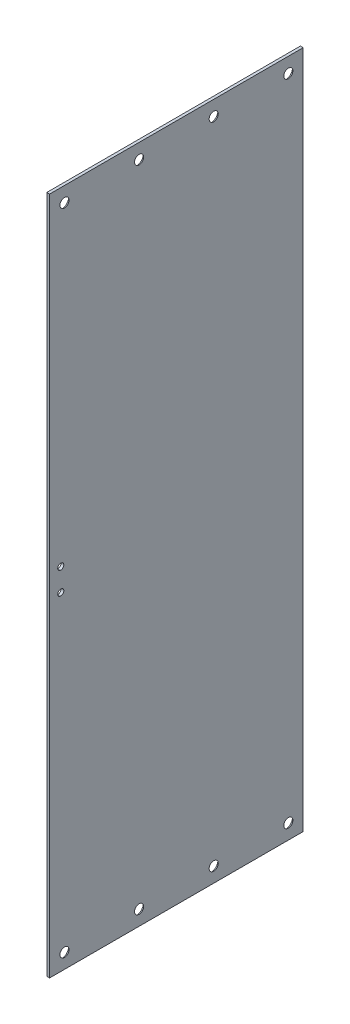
ISO-10303-21;
HEADER;
FILE_DESCRIPTION(('STEP AP214'),'2;1');
FILE_NAME('part.step','',(''),(''),'','','');
FILE_SCHEMA(('AUTOMOTIVE_DESIGN { 1 0 10303 214 1 1 1 1 }'));
ENDSEC;
DATA;
#1=APPLICATION_CONTEXT('core data for automotive mechanical design processes');
#2=APPLICATION_PROTOCOL_DEFINITION('international standard','automotive_design',2000,#1);
#3=PRODUCT_CONTEXT('',#1,'mechanical');
#4=PRODUCT('Part','Part','',(#3));
#5=PRODUCT_RELATED_PRODUCT_CATEGORY('part','',(#4));
#6=PRODUCT_DEFINITION_FORMATION('','',#4);
#7=PRODUCT_DEFINITION_CONTEXT('part definition',#1,'design');
#8=PRODUCT_DEFINITION('design','',#6,#7);
#9=PRODUCT_DEFINITION_SHAPE('','',#8);
#10=(LENGTH_UNIT() NAMED_UNIT(*) SI_UNIT(.MILLI.,.METRE.));
#11=(NAMED_UNIT(*) PLANE_ANGLE_UNIT() SI_UNIT($,.RADIAN.));
#12=(NAMED_UNIT(*) SI_UNIT($,.STERADIAN.) SOLID_ANGLE_UNIT());
#13=UNCERTAINTY_MEASURE_WITH_UNIT(LENGTH_MEASURE(1.E-05),#10,'distance_accuracy_value','');
#14=(GEOMETRIC_REPRESENTATION_CONTEXT(3) GLOBAL_UNCERTAINTY_ASSIGNED_CONTEXT((#13)) GLOBAL_UNIT_ASSIGNED_CONTEXT((#10,
#11,#12)) REPRESENTATION_CONTEXT('',''));
#15=CARTESIAN_POINT('',(0.,0.,0.));
#16=DIRECTION('',(0.,0.,1.));
#17=DIRECTION('',(1.,0.,0.));
#18=AXIS2_PLACEMENT_3D('',#15,#16,#17);
#19=CARTESIAN_POINT('',(-2.3812499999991,-577.85,215.9));
#20=DIRECTION('',(-1.,0.,0.));
#21=DIRECTION('',(0.,0.,1.));
#22=AXIS2_PLACEMENT_3D('',#19,#20,#21);
#23=PLANE('',#22);
#24=DIRECTION('',(0.,0.,1.));
#25=VECTOR('',#24,1.);
#26=CARTESIAN_POINT('',(-2.3812499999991,577.85,-215.9));
#27=LINE('',#26,#25);
#28=CARTESIAN_POINT('',(-2.3812499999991,577.85,-215.9));
#29=VERTEX_POINT('',#28);
#30=CARTESIAN_POINT('',(-2.3812499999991,577.85,215.9));
#31=VERTEX_POINT('',#30);
#32=EDGE_CURVE('E358',#29,#31,#27,.T.);
#33=ORIENTED_EDGE('',*,*,#32,.F.);
#34=DIRECTION('',(0.,1.,0.));
#35=VECTOR('',#34,1.);
#36=CARTESIAN_POINT('',(-2.3812499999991,-577.85,-215.9));
#37=LINE('',#36,#35);
#38=CARTESIAN_POINT('',(-2.3812499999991,-577.85,-215.9));
#39=VERTEX_POINT('',#38);
#40=EDGE_CURVE('E362',#39,#29,#37,.T.);
#41=ORIENTED_EDGE('',*,*,#40,.F.);
#42=DIRECTION('',(0.,0.,-1.));
#43=VECTOR('',#42,1.);
#44=CARTESIAN_POINT('',(-2.3812499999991,-577.85,215.9));
#45=LINE('',#44,#43);
#46=CARTESIAN_POINT('',(-2.3812499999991,-577.85,215.9));
#47=VERTEX_POINT('',#46);
#48=EDGE_CURVE('E366',#47,#39,#45,.T.);
#49=ORIENTED_EDGE('',*,*,#48,.F.);
#50=DIRECTION('',(0.,1.,0.));
#51=VECTOR('',#50,1.);
#52=CARTESIAN_POINT('',(-2.3812499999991,577.85,215.9));
#53=LINE('',#52,#51);
#54=EDGE_CURVE('E373',#31,#47,#53,.F.);
#55=ORIENTED_EDGE('',*,*,#54,.F.);
#56=EDGE_LOOP('',(#33,#41,#49,#55));
#57=FACE_BOUND('',#56,.T.);
#58=CARTESIAN_POINT('',(-2.3812499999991,19.0500000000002,196.85));
#59=DIRECTION('',(-1.,0.,0.));
#60=DIRECTION('',(0.,0.,1.));
#61=AXIS2_PLACEMENT_3D('',#58,#59,#60);
#62=CIRCLE('',#61,5.16001);
#63=CARTESIAN_POINT('',(-2.3812499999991,24.2100100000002,196.85));
#64=VERTEX_POINT('',#63);
#65=CARTESIAN_POINT('',(-2.3812499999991,13.8899900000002,196.85));
#66=VERTEX_POINT('',#65);
#67=EDGE_CURVE('E258',#64,#66,#62,.F.);
#68=ORIENTED_EDGE('',*,*,#67,.T.);
#69=CARTESIAN_POINT('',(-2.3812499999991,19.0500000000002,196.85));
#70=DIRECTION('',(-1.,0.,0.));
#71=DIRECTION('',(0.,0.,1.));
#72=AXIS2_PLACEMENT_3D('',#69,#70,#71);
#73=CIRCLE('',#72,5.16001);
#74=EDGE_CURVE('E254',#66,#64,#73,.F.);
#75=ORIENTED_EDGE('',*,*,#74,.T.);
#76=EDGE_LOOP('',(#68,#75));
#77=FACE_BOUND('',#76,.T.);
#78=CARTESIAN_POINT('',(-2.3812499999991,-19.0499999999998,196.85));
#79=DIRECTION('',(-1.,0.,0.));
#80=DIRECTION('',(0.,0.,1.));
#81=AXIS2_PLACEMENT_3D('',#78,#79,#80);
#82=CIRCLE('',#81,5.16001);
#83=CARTESIAN_POINT('',(-2.3812499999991,-13.8899899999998,196.85));
#84=VERTEX_POINT('',#83);
#85=CARTESIAN_POINT('',(-2.3812499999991,-24.2100099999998,196.85));
#86=VERTEX_POINT('',#85);
#87=EDGE_CURVE('E266',#84,#86,#82,.F.);
#88=ORIENTED_EDGE('',*,*,#87,.T.);
#89=CARTESIAN_POINT('',(-2.3812499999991,-19.0499999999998,196.85));
#90=DIRECTION('',(-1.,0.,0.));
#91=DIRECTION('',(0.,0.,1.));
#92=AXIS2_PLACEMENT_3D('',#89,#90,#91);
#93=CIRCLE('',#92,5.16001);
#94=EDGE_CURVE('E262',#86,#84,#93,.F.);
#95=ORIENTED_EDGE('',*,*,#94,.T.);
#96=EDGE_LOOP('',(#88,#95));
#97=FACE_BOUND('',#96,.T.);
#98=CARTESIAN_POINT('',(-2.3812500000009,552.45,190.5));
#99=DIRECTION('',(-1.,0.,0.));
#100=DIRECTION('',(0.,0.,1.));
#101=AXIS2_PLACEMENT_3D('',#98,#99,#100);
#102=CIRCLE('',#101,11.9062500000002);
#103=CARTESIAN_POINT('',(-2.38124999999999,552.45,202.406249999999));
#104=VERTEX_POINT('',#103);
#105=CARTESIAN_POINT('',(-2.38124999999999,552.45,178.59375));
#106=VERTEX_POINT('',#105);
#107=EDGE_CURVE('E270',#104,#106,#102,.F.);
#108=ORIENTED_EDGE('',*,*,#107,.T.);
#109=CARTESIAN_POINT('',(-2.38124999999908,552.45,190.5));
#110=DIRECTION('',(-1.,0.,0.));
#111=DIRECTION('',(0.,0.,1.));
#112=AXIS2_PLACEMENT_3D('',#109,#110,#111);
#113=CIRCLE('',#112,11.9062499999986);
#114=EDGE_CURVE('E274',#106,#104,#113,.F.);
#115=ORIENTED_EDGE('',*,*,#114,.T.);
#116=EDGE_LOOP('',(#108,#115));
#117=FACE_BOUND('',#116,.T.);
#118=CARTESIAN_POINT('',(-2.3812500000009,552.45,-63.5000000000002));
#119=DIRECTION('',(-1.,0.,0.));
#120=DIRECTION('',(0.,0.,1.));
#121=AXIS2_PLACEMENT_3D('',#118,#119,#120);
#122=CIRCLE('',#121,11.9062500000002);
#123=CARTESIAN_POINT('',(-2.38125,552.45,-51.5937500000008));
#124=VERTEX_POINT('',#123);
#125=CARTESIAN_POINT('',(-2.38125,552.45,-75.4062499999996));
#126=VERTEX_POINT('',#125);
#127=EDGE_CURVE('E278',#124,#126,#122,.F.);
#128=ORIENTED_EDGE('',*,*,#127,.T.);
#129=CARTESIAN_POINT('',(-2.3812499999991,552.45,-63.5000000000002));
#130=DIRECTION('',(-1.,0.,0.));
#131=DIRECTION('',(0.,0.,1.));
#132=AXIS2_PLACEMENT_3D('',#129,#130,#131);
#133=CIRCLE('',#132,11.9062499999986);
#134=EDGE_CURVE('E282',#126,#124,#133,.F.);
#135=ORIENTED_EDGE('',*,*,#134,.T.);
#136=EDGE_LOOP('',(#128,#135));
#137=FACE_BOUND('',#136,.T.);
#138=CARTESIAN_POINT('',(-2.3812500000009,-552.45,190.5));
#139=DIRECTION('',(-1.,0.,0.));
#140=DIRECTION('',(0.,0.,1.));
#141=AXIS2_PLACEMENT_3D('',#138,#139,#140);
#142=CIRCLE('',#141,11.9062500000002);
#143=CARTESIAN_POINT('',(-2.38124999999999,-552.45,202.406249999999));
#144=VERTEX_POINT('',#143);
#145=CARTESIAN_POINT('',(-2.38124999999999,-552.45,178.59375));
#146=VERTEX_POINT('',#145);
#147=EDGE_CURVE('E286',#144,#146,#142,.F.);
#148=ORIENTED_EDGE('',*,*,#147,.T.);
#149=CARTESIAN_POINT('',(-2.38124999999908,-552.45,190.5));
#150=DIRECTION('',(-1.,0.,0.));
#151=DIRECTION('',(0.,0.,1.));
#152=AXIS2_PLACEMENT_3D('',#149,#150,#151);
#153=CIRCLE('',#152,11.9062499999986);
#154=EDGE_CURVE('E290',#146,#144,#153,.F.);
#155=ORIENTED_EDGE('',*,*,#154,.T.);
#156=EDGE_LOOP('',(#148,#155));
#157=FACE_BOUND('',#156,.T.);
#158=CARTESIAN_POINT('',(-2.3812500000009,-552.45,-63.5000000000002));
#159=DIRECTION('',(-1.,0.,0.));
#160=DIRECTION('',(0.,0.,1.));
#161=AXIS2_PLACEMENT_3D('',#158,#159,#160);
#162=CIRCLE('',#161,11.9062500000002);
#163=CARTESIAN_POINT('',(-2.38125,-552.45,-51.5937500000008));
#164=VERTEX_POINT('',#163);
#165=CARTESIAN_POINT('',(-2.38125,-552.45,-75.4062499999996));
#166=VERTEX_POINT('',#165);
#167=EDGE_CURVE('E294',#164,#166,#162,.F.);
#168=ORIENTED_EDGE('',*,*,#167,.T.);
#169=CARTESIAN_POINT('',(-2.3812499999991,-552.45,-63.5000000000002));
#170=DIRECTION('',(-1.,0.,0.));
#171=DIRECTION('',(0.,0.,1.));
#172=AXIS2_PLACEMENT_3D('',#169,#170,#171);
#173=CIRCLE('',#172,11.9062499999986);
#174=EDGE_CURVE('E298',#166,#164,#173,.F.);
#175=ORIENTED_EDGE('',*,*,#174,.T.);
#176=EDGE_LOOP('',(#168,#175));
#177=FACE_BOUND('',#176,.T.);
#178=CARTESIAN_POINT('',(-2.3812500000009,-552.45,-190.5));
#179=DIRECTION('',(-1.,0.,0.));
#180=DIRECTION('',(0.,0.,1.));
#181=AXIS2_PLACEMENT_3D('',#178,#179,#180);
#182=CIRCLE('',#181,11.9062500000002);
#183=CARTESIAN_POINT('',(-2.38124999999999,-552.45,-178.593750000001));
#184=VERTEX_POINT('',#183);
#185=CARTESIAN_POINT('',(-2.38124999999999,-552.45,-202.40625));
#186=VERTEX_POINT('',#185);
#187=EDGE_CURVE('E302',#184,#186,#182,.F.);
#188=ORIENTED_EDGE('',*,*,#187,.T.);
#189=CARTESIAN_POINT('',(-2.38124999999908,-552.45,-190.5));
#190=DIRECTION('',(-1.,0.,0.));
#191=DIRECTION('',(0.,0.,1.));
#192=AXIS2_PLACEMENT_3D('',#189,#190,#191);
#193=CIRCLE('',#192,11.9062499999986);
#194=EDGE_CURVE('E306',#186,#184,#193,.F.);
#195=ORIENTED_EDGE('',*,*,#194,.T.);
#196=EDGE_LOOP('',(#188,#195));
#197=FACE_BOUND('',#196,.T.);
#198=CARTESIAN_POINT('',(-2.3812500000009,-552.45,63.4999999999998));
#199=DIRECTION('',(-1.,0.,0.));
#200=DIRECTION('',(0.,0.,1.));
#201=AXIS2_PLACEMENT_3D('',#198,#199,#200);
#202=CIRCLE('',#201,11.9062500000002);
#203=CARTESIAN_POINT('',(-2.38125,-552.45,75.4062499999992));
#204=VERTEX_POINT('',#203);
#205=CARTESIAN_POINT('',(-2.38125,-552.45,51.5937500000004));
#206=VERTEX_POINT('',#205);
#207=EDGE_CURVE('E310',#204,#206,#202,.F.);
#208=ORIENTED_EDGE('',*,*,#207,.T.);
#209=CARTESIAN_POINT('',(-2.3812499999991,-552.45,63.4999999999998));
#210=DIRECTION('',(-1.,0.,0.));
#211=DIRECTION('',(0.,0.,1.));
#212=AXIS2_PLACEMENT_3D('',#209,#210,#211);
#213=CIRCLE('',#212,11.9062499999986);
#214=EDGE_CURVE('E314',#206,#204,#213,.F.);
#215=ORIENTED_EDGE('',*,*,#214,.T.);
#216=EDGE_LOOP('',(#208,#215));
#217=FACE_BOUND('',#216,.T.);
#218=CARTESIAN_POINT('',(-2.3812500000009,552.45,-190.5));
#219=DIRECTION('',(-1.,0.,0.));
#220=DIRECTION('',(0.,0.,1.));
#221=AXIS2_PLACEMENT_3D('',#218,#219,#220);
#222=CIRCLE('',#221,11.9062500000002);
#223=CARTESIAN_POINT('',(-2.38124999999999,552.45,-178.593750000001));
#224=VERTEX_POINT('',#223);
#225=CARTESIAN_POINT('',(-2.38124999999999,552.45,-202.40625));
#226=VERTEX_POINT('',#225);
#227=EDGE_CURVE('E191',#224,#226,#222,.F.);
#228=ORIENTED_EDGE('',*,*,#227,.T.);
#229=CARTESIAN_POINT('',(-2.38124999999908,552.45,-190.5));
#230=DIRECTION('',(-1.,0.,0.));
#231=DIRECTION('',(0.,0.,1.));
#232=AXIS2_PLACEMENT_3D('',#229,#230,#231);
#233=CIRCLE('',#232,11.9062499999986);
#234=EDGE_CURVE('E188',#226,#224,#233,.F.);
#235=ORIENTED_EDGE('',*,*,#234,.T.);
#236=EDGE_LOOP('',(#228,#235));
#237=FACE_BOUND('',#236,.T.);
#238=CARTESIAN_POINT('',(-2.3812500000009,552.45,63.4999999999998));
#239=DIRECTION('',(-1.,0.,0.));
#240=DIRECTION('',(0.,0.,1.));
#241=AXIS2_PLACEMENT_3D('',#238,#239,#240);
#242=CIRCLE('',#241,11.9062500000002);
#243=CARTESIAN_POINT('',(-2.38125,552.45,75.4062499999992));
#244=VERTEX_POINT('',#243);
#245=CARTESIAN_POINT('',(-2.38125,552.45,51.5937500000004));
#246=VERTEX_POINT('',#245);
#247=EDGE_CURVE('E178',#244,#246,#242,.F.);
#248=ORIENTED_EDGE('',*,*,#247,.T.);
#249=CARTESIAN_POINT('',(-2.3812499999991,552.45,63.4999999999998));
#250=DIRECTION('',(-1.,0.,0.));
#251=DIRECTION('',(0.,0.,1.));
#252=AXIS2_PLACEMENT_3D('',#249,#250,#251);
#253=CIRCLE('',#252,11.9062499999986);
#254=EDGE_CURVE('E19',#246,#244,#253,.F.);
#255=ORIENTED_EDGE('',*,*,#254,.T.);
#256=EDGE_LOOP('',(#248,#255));
#257=FACE_BOUND('',#256,.T.);
#258=ADVANCED_FACE('F16',(#57,#77,#97,#117,#137,#157,#177,#197,#217,#237,#257),#23,.T.);
#259=CARTESIAN_POINT('',(-2.3812499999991,552.45,63.4999999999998));
#260=DIRECTION('',(-1.,0.,0.));
#261=DIRECTION('',(0.,0.,1.));
#262=AXIS2_PLACEMENT_3D('',#259,#260,#261);
#263=CONICAL_SURFACE('',#262,11.9062499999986,0.715584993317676);
#264=ORIENTED_EDGE('',*,*,#254,.F.);
#265=DIRECTION('',(0.754709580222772,0.,0.656059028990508));
#266=VECTOR('',#265,1.);
#267=CARTESIAN_POINT('',(0.806449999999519,552.45,54.3647753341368));
#268=LINE('',#267,#266);
#269=CARTESIAN_POINT('',(2.3812500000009,552.45,55.733728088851));
#270=VERTEX_POINT('',#269);
#271=EDGE_CURVE('E183',#246,#270,#268,.T.);
#272=ORIENTED_EDGE('',*,*,#271,.T.);
#273=CARTESIAN_POINT('',(2.3812500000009,552.45,63.4999999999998));
#274=DIRECTION('',(-1.,0.,0.));
#275=DIRECTION('',(0.,0.,1.));
#276=AXIS2_PLACEMENT_3D('',#273,#274,#275);
#277=CIRCLE('',#276,7.76627191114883);
#278=CARTESIAN_POINT('',(2.3812500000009,552.45,71.2662719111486));
#279=VERTEX_POINT('',#278);
#280=EDGE_CURVE('E187',#270,#279,#277,.F.);
#281=ORIENTED_EDGE('',*,*,#280,.T.);
#282=DIRECTION('',(0.754709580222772,0.,-0.656059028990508));
#283=VECTOR('',#282,1.);
#284=CARTESIAN_POINT('',(0.806449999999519,552.45,72.6352246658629));
#285=LINE('',#284,#283);
#286=EDGE_CURVE('E181',#279,#244,#285,.F.);
#287=ORIENTED_EDGE('',*,*,#286,.T.);
#288=EDGE_LOOP('',(#264,#272,#281,#287));
#289=FACE_BOUND('',#288,.T.);
#290=ADVANCED_FACE('F186',(#289),#263,.F.);
#291=CARTESIAN_POINT('',(-2.38125000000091,552.45,63.4999999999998));
#292=DIRECTION('',(-1.,0.,0.));
#293=DIRECTION('',(0.,0.,1.));
#294=AXIS2_PLACEMENT_3D('',#291,#292,#293);
#295=CONICAL_SURFACE('',#294,11.9062500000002,0.715584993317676);
#296=CARTESIAN_POINT('',(2.3812500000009,552.45,63.4999999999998));
#297=DIRECTION('',(-1.,0.,0.));
#298=DIRECTION('',(0.,0.,1.));
#299=AXIS2_PLACEMENT_3D('',#296,#297,#298);
#300=CIRCLE('',#299,7.76627191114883);
#301=EDGE_CURVE('E251',#279,#270,#300,.F.);
#302=ORIENTED_EDGE('',*,*,#301,.T.);
#303=ORIENTED_EDGE('',*,*,#271,.F.);
#304=ORIENTED_EDGE('',*,*,#247,.F.);
#305=ORIENTED_EDGE('',*,*,#286,.F.);
#306=EDGE_LOOP('',(#302,#303,#304,#305));
#307=FACE_BOUND('',#306,.T.);
#308=ADVANCED_FACE('F180',(#307),#295,.F.);
#309=CARTESIAN_POINT('',(-2.38124999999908,552.45,-190.5));
#310=DIRECTION('',(-1.,0.,0.));
#311=DIRECTION('',(0.,0.,1.));
#312=AXIS2_PLACEMENT_3D('',#309,#310,#311);
#313=CONICAL_SURFACE('',#312,11.9062499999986,0.715584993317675);
#314=ORIENTED_EDGE('',*,*,#234,.F.);
#315=DIRECTION('',(0.754709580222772,0.,0.656059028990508));
#316=VECTOR('',#315,1.);
#317=CARTESIAN_POINT('',(0.806449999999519,552.45,-199.635224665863));
#318=LINE('',#317,#316);
#319=CARTESIAN_POINT('',(2.3812500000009,552.45,-198.266271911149));
#320=VERTEX_POINT('',#319);
#321=EDGE_CURVE('E319',#226,#320,#318,.T.);
#322=ORIENTED_EDGE('',*,*,#321,.T.);
#323=CARTESIAN_POINT('',(2.38125000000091,552.45,-190.5));
#324=DIRECTION('',(-1.,0.,0.));
#325=DIRECTION('',(0.,0.,1.));
#326=AXIS2_PLACEMENT_3D('',#323,#324,#325);
#327=CIRCLE('',#326,7.76627191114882);
#328=CARTESIAN_POINT('',(2.3812500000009,552.45,-182.733728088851));
#329=VERTEX_POINT('',#328);
#330=EDGE_CURVE('E248',#320,#329,#327,.F.);
#331=ORIENTED_EDGE('',*,*,#330,.T.);
#332=DIRECTION('',(0.754709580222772,0.,-0.656059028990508));
#333=VECTOR('',#332,1.);
#334=CARTESIAN_POINT('',(0.806449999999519,552.45,-181.364775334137));
#335=LINE('',#334,#333);
#336=EDGE_CURVE('E317',#329,#224,#335,.F.);
#337=ORIENTED_EDGE('',*,*,#336,.T.);
#338=EDGE_LOOP('',(#314,#322,#331,#337));
#339=FACE_BOUND('',#338,.T.);
#340=ADVANCED_FACE('F482',(#339),#313,.F.);
#341=CARTESIAN_POINT('',(-2.3812500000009,552.45,-190.5));
#342=DIRECTION('',(-1.,0.,0.));
#343=DIRECTION('',(0.,0.,1.));
#344=AXIS2_PLACEMENT_3D('',#341,#342,#343);
#345=CONICAL_SURFACE('',#344,11.9062500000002,0.715584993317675);
#346=CARTESIAN_POINT('',(2.3812500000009,552.45,-190.5));
#347=DIRECTION('',(-1.,0.,0.));
#348=DIRECTION('',(0.,0.,1.));
#349=AXIS2_PLACEMENT_3D('',#346,#347,#348);
#350=CIRCLE('',#349,7.76627191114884);
#351=EDGE_CURVE('E245',#329,#320,#350,.F.);
#352=ORIENTED_EDGE('',*,*,#351,.T.);
#353=ORIENTED_EDGE('',*,*,#321,.F.);
#354=ORIENTED_EDGE('',*,*,#227,.F.);
#355=ORIENTED_EDGE('',*,*,#336,.F.);
#356=EDGE_LOOP('',(#352,#353,#354,#355));
#357=FACE_BOUND('',#356,.T.);
#358=ADVANCED_FACE('F478',(#357),#345,.F.);
#359=CARTESIAN_POINT('',(-2.3812499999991,-552.45,63.4999999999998));
#360=DIRECTION('',(-1.,0.,0.));
#361=DIRECTION('',(0.,0.,1.));
#362=AXIS2_PLACEMENT_3D('',#359,#360,#361);
#363=CONICAL_SURFACE('',#362,11.9062499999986,0.715584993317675);
#364=ORIENTED_EDGE('',*,*,#214,.F.);
#365=DIRECTION('',(0.754709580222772,0.,0.656059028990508));
#366=VECTOR('',#365,1.);
#367=CARTESIAN_POINT('',(0.806449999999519,-552.45,54.3647753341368));
#368=LINE('',#367,#366);
#369=CARTESIAN_POINT('',(2.3812500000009,-552.45,55.733728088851));
#370=VERTEX_POINT('',#369);
#371=EDGE_CURVE('E313',#206,#370,#368,.T.);
#372=ORIENTED_EDGE('',*,*,#371,.T.);
#373=CARTESIAN_POINT('',(2.3812500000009,-552.45,63.4999999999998));
#374=DIRECTION('',(-1.,0.,0.));
#375=DIRECTION('',(0.,0.,1.));
#376=AXIS2_PLACEMENT_3D('',#373,#374,#375);
#377=CIRCLE('',#376,7.76627191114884);
#378=CARTESIAN_POINT('',(2.3812500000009,-552.45,71.2662719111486));
#379=VERTEX_POINT('',#378);
#380=EDGE_CURVE('E242',#370,#379,#377,.F.);
#381=ORIENTED_EDGE('',*,*,#380,.T.);
#382=DIRECTION('',(0.754709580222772,0.,-0.656059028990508));
#383=VECTOR('',#382,1.);
#384=CARTESIAN_POINT('',(0.806449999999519,-552.45,72.6352246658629));
#385=LINE('',#384,#383);
#386=EDGE_CURVE('E309',#379,#204,#385,.F.);
#387=ORIENTED_EDGE('',*,*,#386,.T.);
#388=EDGE_LOOP('',(#364,#372,#381,#387));
#389=FACE_BOUND('',#388,.T.);
#390=ADVANCED_FACE('F474',(#389),#363,.F.);
#391=CARTESIAN_POINT('',(-2.38125000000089,-552.45,63.4999999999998));
#392=DIRECTION('',(-1.,0.,0.));
#393=DIRECTION('',(0.,0.,1.));
#394=AXIS2_PLACEMENT_3D('',#391,#392,#393);
#395=CONICAL_SURFACE('',#394,11.9062500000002,0.715584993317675);
#396=CARTESIAN_POINT('',(2.3812500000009,-552.45,63.4999999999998));
#397=DIRECTION('',(-1.,0.,0.));
#398=DIRECTION('',(0.,0.,1.));
#399=AXIS2_PLACEMENT_3D('',#396,#397,#398);
#400=CIRCLE('',#399,7.76627191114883);
#401=EDGE_CURVE('E239',#379,#370,#400,.F.);
#402=ORIENTED_EDGE('',*,*,#401,.T.);
#403=ORIENTED_EDGE('',*,*,#371,.F.);
#404=ORIENTED_EDGE('',*,*,#207,.F.);
#405=ORIENTED_EDGE('',*,*,#386,.F.);
#406=EDGE_LOOP('',(#402,#403,#404,#405));
#407=FACE_BOUND('',#406,.T.);
#408=ADVANCED_FACE('F470',(#407),#395,.F.);
#409=CARTESIAN_POINT('',(-2.38124999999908,-552.45,-190.5));
#410=DIRECTION('',(-1.,0.,0.));
#411=DIRECTION('',(0.,0.,1.));
#412=AXIS2_PLACEMENT_3D('',#409,#410,#411);
#413=CONICAL_SURFACE('',#412,11.9062499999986,0.715584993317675);
#414=ORIENTED_EDGE('',*,*,#194,.F.);
#415=DIRECTION('',(0.754709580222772,0.,0.656059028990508));
#416=VECTOR('',#415,1.);
#417=CARTESIAN_POINT('',(0.806449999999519,-552.45,-199.635224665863));
#418=LINE('',#417,#416);
#419=CARTESIAN_POINT('',(2.3812500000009,-552.45,-198.266271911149));
#420=VERTEX_POINT('',#419);
#421=EDGE_CURVE('E305',#186,#420,#418,.T.);
#422=ORIENTED_EDGE('',*,*,#421,.T.);
#423=CARTESIAN_POINT('',(2.38125000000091,-552.45,-190.5));
#424=DIRECTION('',(-1.,0.,0.));
#425=DIRECTION('',(0.,0.,1.));
#426=AXIS2_PLACEMENT_3D('',#423,#424,#425);
#427=CIRCLE('',#426,7.76627191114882);
#428=CARTESIAN_POINT('',(2.3812500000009,-552.45,-182.733728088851));
#429=VERTEX_POINT('',#428);
#430=EDGE_CURVE('E236',#420,#429,#427,.F.);
#431=ORIENTED_EDGE('',*,*,#430,.T.);
#432=DIRECTION('',(0.754709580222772,0.,-0.656059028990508));
#433=VECTOR('',#432,1.);
#434=CARTESIAN_POINT('',(0.806449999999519,-552.45,-181.364775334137));
#435=LINE('',#434,#433);
#436=EDGE_CURVE('E301',#429,#184,#435,.F.);
#437=ORIENTED_EDGE('',*,*,#436,.T.);
#438=EDGE_LOOP('',(#414,#422,#431,#437));
#439=FACE_BOUND('',#438,.T.);
#440=ADVANCED_FACE('F466',(#439),#413,.F.);
#441=CARTESIAN_POINT('',(-2.3812500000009,-552.45,-190.5));
#442=DIRECTION('',(-1.,0.,0.));
#443=DIRECTION('',(0.,0.,1.));
#444=AXIS2_PLACEMENT_3D('',#441,#442,#443);
#445=CONICAL_SURFACE('',#444,11.9062500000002,0.715584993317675);
#446=CARTESIAN_POINT('',(2.3812500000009,-552.45,-190.5));
#447=DIRECTION('',(-1.,0.,0.));
#448=DIRECTION('',(0.,0.,1.));
#449=AXIS2_PLACEMENT_3D('',#446,#447,#448);
#450=CIRCLE('',#449,7.76627191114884);
#451=EDGE_CURVE('E233',#429,#420,#450,.F.);
#452=ORIENTED_EDGE('',*,*,#451,.T.);
#453=ORIENTED_EDGE('',*,*,#421,.F.);
#454=ORIENTED_EDGE('',*,*,#187,.F.);
#455=ORIENTED_EDGE('',*,*,#436,.F.);
#456=EDGE_LOOP('',(#452,#453,#454,#455));
#457=FACE_BOUND('',#456,.T.);
#458=ADVANCED_FACE('F462',(#457),#445,.F.);
#459=CARTESIAN_POINT('',(-2.3812499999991,-552.45,-63.5000000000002));
#460=DIRECTION('',(-1.,0.,0.));
#461=DIRECTION('',(0.,0.,1.));
#462=AXIS2_PLACEMENT_3D('',#459,#460,#461);
#463=CONICAL_SURFACE('',#462,11.9062499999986,0.715584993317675);
#464=ORIENTED_EDGE('',*,*,#174,.F.);
#465=DIRECTION('',(0.754709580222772,0.,0.656059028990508));
#466=VECTOR('',#465,1.);
#467=CARTESIAN_POINT('',(0.806449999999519,-552.45,-72.6352246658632));
#468=LINE('',#467,#466);
#469=CARTESIAN_POINT('',(2.3812500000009,-552.45,-71.266271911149));
#470=VERTEX_POINT('',#469);
#471=EDGE_CURVE('E297',#166,#470,#468,.T.);
#472=ORIENTED_EDGE('',*,*,#471,.T.);
#473=CARTESIAN_POINT('',(2.3812500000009,-552.45,-63.5000000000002));
#474=DIRECTION('',(-1.,0.,0.));
#475=DIRECTION('',(0.,0.,1.));
#476=AXIS2_PLACEMENT_3D('',#473,#474,#475);
#477=CIRCLE('',#476,7.76627191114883);
#478=CARTESIAN_POINT('',(2.3812500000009,-552.45,-55.7337280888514));
#479=VERTEX_POINT('',#478);
#480=EDGE_CURVE('E230',#470,#479,#477,.F.);
#481=ORIENTED_EDGE('',*,*,#480,.T.);
#482=DIRECTION('',(0.754709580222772,0.,-0.656059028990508));
#483=VECTOR('',#482,1.);
#484=CARTESIAN_POINT('',(0.806449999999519,-552.45,-54.3647753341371));
#485=LINE('',#484,#483);
#486=EDGE_CURVE('E293',#479,#164,#485,.F.);
#487=ORIENTED_EDGE('',*,*,#486,.T.);
#488=EDGE_LOOP('',(#464,#472,#481,#487));
#489=FACE_BOUND('',#488,.T.);
#490=ADVANCED_FACE('F458',(#489),#463,.F.);
#491=CARTESIAN_POINT('',(-2.38125000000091,-552.45,-63.5000000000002));
#492=DIRECTION('',(-1.,0.,0.));
#493=DIRECTION('',(0.,0.,1.));
#494=AXIS2_PLACEMENT_3D('',#491,#492,#493);
#495=CONICAL_SURFACE('',#494,11.9062500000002,0.715584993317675);
#496=CARTESIAN_POINT('',(2.3812500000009,-552.45,-63.5000000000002));
#497=DIRECTION('',(-1.,0.,0.));
#498=DIRECTION('',(0.,0.,1.));
#499=AXIS2_PLACEMENT_3D('',#496,#497,#498);
#500=CIRCLE('',#499,7.76627191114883);
#501=EDGE_CURVE('E227',#479,#470,#500,.F.);
#502=ORIENTED_EDGE('',*,*,#501,.T.);
#503=ORIENTED_EDGE('',*,*,#471,.F.);
#504=ORIENTED_EDGE('',*,*,#167,.F.);
#505=ORIENTED_EDGE('',*,*,#486,.F.);
#506=EDGE_LOOP('',(#502,#503,#504,#505));
#507=FACE_BOUND('',#506,.T.);
#508=ADVANCED_FACE('F454',(#507),#495,.F.);
#509=CARTESIAN_POINT('',(-2.38124999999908,-552.45,190.5));
#510=DIRECTION('',(-1.,0.,0.));
#511=DIRECTION('',(0.,0.,1.));
#512=AXIS2_PLACEMENT_3D('',#509,#510,#511);
#513=CONICAL_SURFACE('',#512,11.9062499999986,0.715584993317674);
#514=ORIENTED_EDGE('',*,*,#154,.F.);
#515=DIRECTION('',(0.754709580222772,0.,0.656059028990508));
#516=VECTOR('',#515,1.);
#517=CARTESIAN_POINT('',(0.806449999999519,-552.45,181.364775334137));
#518=LINE('',#517,#516);
#519=CARTESIAN_POINT('',(2.38125000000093,-552.45,182.733728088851));
#520=VERTEX_POINT('',#519);
#521=EDGE_CURVE('E289',#146,#520,#518,.T.);
#522=ORIENTED_EDGE('',*,*,#521,.T.);
#523=CARTESIAN_POINT('',(2.3812500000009,-552.45,190.5));
#524=DIRECTION('',(-1.,0.,0.));
#525=DIRECTION('',(0.,0.,1.));
#526=AXIS2_PLACEMENT_3D('',#523,#524,#525);
#527=CIRCLE('',#526,7.76627191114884);
#528=CARTESIAN_POINT('',(2.38125000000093,-552.45,198.266271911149));
#529=VERTEX_POINT('',#528);
#530=EDGE_CURVE('E224',#520,#529,#527,.F.);
#531=ORIENTED_EDGE('',*,*,#530,.T.);
#532=DIRECTION('',(0.754709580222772,0.,-0.656059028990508));
#533=VECTOR('',#532,1.);
#534=CARTESIAN_POINT('',(0.806449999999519,-552.45,199.635224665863));
#535=LINE('',#534,#533);
#536=EDGE_CURVE('E285',#529,#144,#535,.F.);
#537=ORIENTED_EDGE('',*,*,#536,.T.);
#538=EDGE_LOOP('',(#514,#522,#531,#537));
#539=FACE_BOUND('',#538,.T.);
#540=ADVANCED_FACE('F450',(#539),#513,.F.);
#541=CARTESIAN_POINT('',(-2.3812500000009,-552.45,190.5));
#542=DIRECTION('',(-1.,0.,0.));
#543=DIRECTION('',(0.,0.,1.));
#544=AXIS2_PLACEMENT_3D('',#541,#542,#543);
#545=CONICAL_SURFACE('',#544,11.9062500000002,0.715584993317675);
#546=CARTESIAN_POINT('',(2.38125000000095,-552.45,190.5));
#547=DIRECTION('',(-1.,0.,0.));
#548=DIRECTION('',(0.,0.,1.));
#549=AXIS2_PLACEMENT_3D('',#546,#547,#548);
#550=CIRCLE('',#549,7.76627191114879);
#551=EDGE_CURVE('E221',#529,#520,#550,.F.);
#552=ORIENTED_EDGE('',*,*,#551,.T.);
#553=ORIENTED_EDGE('',*,*,#521,.F.);
#554=ORIENTED_EDGE('',*,*,#147,.F.);
#555=ORIENTED_EDGE('',*,*,#536,.F.);
#556=EDGE_LOOP('',(#552,#553,#554,#555));
#557=FACE_BOUND('',#556,.T.);
#558=ADVANCED_FACE('F446',(#557),#545,.F.);
#559=CARTESIAN_POINT('',(-2.3812499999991,552.45,-63.5000000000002));
#560=DIRECTION('',(-1.,0.,0.));
#561=DIRECTION('',(0.,0.,1.));
#562=AXIS2_PLACEMENT_3D('',#559,#560,#561);
#563=CONICAL_SURFACE('',#562,11.9062499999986,0.715584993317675);
#564=ORIENTED_EDGE('',*,*,#134,.F.);
#565=DIRECTION('',(0.754709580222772,0.,0.656059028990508));
#566=VECTOR('',#565,1.);
#567=CARTESIAN_POINT('',(0.806449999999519,552.45,-72.6352246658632));
#568=LINE('',#567,#566);
#569=CARTESIAN_POINT('',(2.3812500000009,552.45,-71.266271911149));
#570=VERTEX_POINT('',#569);
#571=EDGE_CURVE('E281',#126,#570,#568,.T.);
#572=ORIENTED_EDGE('',*,*,#571,.T.);
#573=CARTESIAN_POINT('',(2.3812500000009,552.45,-63.5000000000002));
#574=DIRECTION('',(-1.,0.,0.));
#575=DIRECTION('',(0.,0.,1.));
#576=AXIS2_PLACEMENT_3D('',#573,#574,#575);
#577=CIRCLE('',#576,7.76627191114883);
#578=CARTESIAN_POINT('',(2.3812500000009,552.45,-55.7337280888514));
#579=VERTEX_POINT('',#578);
#580=EDGE_CURVE('E218',#570,#579,#577,.F.);
#581=ORIENTED_EDGE('',*,*,#580,.T.);
#582=DIRECTION('',(0.754709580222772,0.,-0.656059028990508));
#583=VECTOR('',#582,1.);
#584=CARTESIAN_POINT('',(0.806449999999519,552.45,-54.3647753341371));
#585=LINE('',#584,#583);
#586=EDGE_CURVE('E277',#579,#124,#585,.F.);
#587=ORIENTED_EDGE('',*,*,#586,.T.);
#588=EDGE_LOOP('',(#564,#572,#581,#587));
#589=FACE_BOUND('',#588,.T.);
#590=ADVANCED_FACE('F442',(#589),#563,.F.);
#591=CARTESIAN_POINT('',(-2.38125000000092,552.45,-63.5000000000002));
#592=DIRECTION('',(-1.,0.,0.));
#593=DIRECTION('',(0.,0.,1.));
#594=AXIS2_PLACEMENT_3D('',#591,#592,#593);
#595=CONICAL_SURFACE('',#594,11.9062500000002,0.715584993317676);
#596=CARTESIAN_POINT('',(2.3812500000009,552.45,-63.5000000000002));
#597=DIRECTION('',(-1.,0.,0.));
#598=DIRECTION('',(0.,0.,1.));
#599=AXIS2_PLACEMENT_3D('',#596,#597,#598);
#600=CIRCLE('',#599,7.76627191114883);
#601=EDGE_CURVE('E215',#579,#570,#600,.F.);
#602=ORIENTED_EDGE('',*,*,#601,.T.);
#603=ORIENTED_EDGE('',*,*,#571,.F.);
#604=ORIENTED_EDGE('',*,*,#127,.F.);
#605=ORIENTED_EDGE('',*,*,#586,.F.);
#606=EDGE_LOOP('',(#602,#603,#604,#605));
#607=FACE_BOUND('',#606,.T.);
#608=ADVANCED_FACE('F438',(#607),#595,.F.);
#609=CARTESIAN_POINT('',(-2.38124999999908,552.45,190.5));
#610=DIRECTION('',(-1.,0.,0.));
#611=DIRECTION('',(0.,0.,1.));
#612=AXIS2_PLACEMENT_3D('',#609,#610,#611);
#613=CONICAL_SURFACE('',#612,11.9062499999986,0.715584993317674);
#614=ORIENTED_EDGE('',*,*,#114,.F.);
#615=DIRECTION('',(0.754709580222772,0.,0.656059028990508));
#616=VECTOR('',#615,1.);
#617=CARTESIAN_POINT('',(0.806449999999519,552.45,181.364775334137));
#618=LINE('',#617,#616);
#619=CARTESIAN_POINT('',(2.38125000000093,552.45,182.733728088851));
#620=VERTEX_POINT('',#619);
#621=EDGE_CURVE('E273',#106,#620,#618,.T.);
#622=ORIENTED_EDGE('',*,*,#621,.T.);
#623=CARTESIAN_POINT('',(2.3812500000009,552.45,190.5));
#624=DIRECTION('',(-1.,0.,0.));
#625=DIRECTION('',(0.,0.,1.));
#626=AXIS2_PLACEMENT_3D('',#623,#624,#625);
#627=CIRCLE('',#626,7.76627191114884);
#628=CARTESIAN_POINT('',(2.38125000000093,552.45,198.266271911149));
#629=VERTEX_POINT('',#628);
#630=EDGE_CURVE('E212',#620,#629,#627,.F.);
#631=ORIENTED_EDGE('',*,*,#630,.T.);
#632=DIRECTION('',(0.754709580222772,0.,-0.656059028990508));
#633=VECTOR('',#632,1.);
#634=CARTESIAN_POINT('',(0.806449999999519,552.45,199.635224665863));
#635=LINE('',#634,#633);
#636=EDGE_CURVE('E269',#629,#104,#635,.F.);
#637=ORIENTED_EDGE('',*,*,#636,.T.);
#638=EDGE_LOOP('',(#614,#622,#631,#637));
#639=FACE_BOUND('',#638,.T.);
#640=ADVANCED_FACE('F434',(#639),#613,.F.);
#641=CARTESIAN_POINT('',(-2.3812500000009,552.45,190.5));
#642=DIRECTION('',(-1.,0.,0.));
#643=DIRECTION('',(0.,0.,1.));
#644=AXIS2_PLACEMENT_3D('',#641,#642,#643);
#645=CONICAL_SURFACE('',#644,11.9062500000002,0.715584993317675);
#646=CARTESIAN_POINT('',(2.38125000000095,552.45,190.5));
#647=DIRECTION('',(-1.,0.,0.));
#648=DIRECTION('',(0.,0.,1.));
#649=AXIS2_PLACEMENT_3D('',#646,#647,#648);
#650=CIRCLE('',#649,7.76627191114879);
#651=EDGE_CURVE('E209',#629,#620,#650,.F.);
#652=ORIENTED_EDGE('',*,*,#651,.T.);
#653=ORIENTED_EDGE('',*,*,#621,.F.);
#654=ORIENTED_EDGE('',*,*,#107,.F.);
#655=ORIENTED_EDGE('',*,*,#636,.F.);
#656=EDGE_LOOP('',(#652,#653,#654,#655));
#657=FACE_BOUND('',#656,.T.);
#658=ADVANCED_FACE('F430',(#657),#645,.F.);
#659=CARTESIAN_POINT('',(-4.37514999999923,-19.0499999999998,196.85));
#660=DIRECTION('',(-1.,0.,0.));
#661=DIRECTION('',(0.,0.,1.));
#662=AXIS2_PLACEMENT_3D('',#659,#660,#661);
#663=CYLINDRICAL_SURFACE('',#662,5.16001);
#664=ORIENTED_EDGE('',*,*,#87,.F.);
#665=DIRECTION('',(-1.,0.,0.));
#666=VECTOR('',#665,1.);
#667=CARTESIAN_POINT('',(-4.37514999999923,-13.8899899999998,196.85));
#668=LINE('',#667,#666);
#669=CARTESIAN_POINT('',(2.3812500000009,-13.8899899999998,196.85));
#670=VERTEX_POINT('',#669);
#671=EDGE_CURVE('E265',#84,#670,#668,.F.);
#672=ORIENTED_EDGE('',*,*,#671,.T.);
#673=CARTESIAN_POINT('',(2.3812500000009,-19.0499999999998,196.85));
#674=DIRECTION('',(-1.,0.,0.));
#675=DIRECTION('',(0.,0.,1.));
#676=AXIS2_PLACEMENT_3D('',#673,#674,#675);
#677=CIRCLE('',#676,5.16001);
#678=CARTESIAN_POINT('',(2.3812500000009,-24.2100099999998,196.85));
#679=VERTEX_POINT('',#678);
#680=EDGE_CURVE('E206',#670,#679,#677,.F.);
#681=ORIENTED_EDGE('',*,*,#680,.T.);
#682=DIRECTION('',(-1.,0.,0.));
#683=VECTOR('',#682,1.);
#684=CARTESIAN_POINT('',(-4.37514999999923,-24.2100099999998,196.85));
#685=LINE('',#684,#683);
#686=EDGE_CURVE('E261',#679,#86,#685,.T.);
#687=ORIENTED_EDGE('',*,*,#686,.T.);
#688=EDGE_LOOP('',(#664,#672,#681,#687));
#689=FACE_BOUND('',#688,.T.);
#690=ADVANCED_FACE('F426',(#689),#663,.F.);
#691=CARTESIAN_POINT('',(-4.37514999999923,-19.0499999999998,196.85));
#692=DIRECTION('',(-1.,0.,0.));
#693=DIRECTION('',(0.,0.,1.));
#694=AXIS2_PLACEMENT_3D('',#691,#692,#693);
#695=CYLINDRICAL_SURFACE('',#694,5.16001);
#696=CARTESIAN_POINT('',(2.3812500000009,-19.0499999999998,196.85));
#697=DIRECTION('',(-1.,0.,0.));
#698=DIRECTION('',(0.,0.,1.));
#699=AXIS2_PLACEMENT_3D('',#696,#697,#698);
#700=CIRCLE('',#699,5.16001);
#701=EDGE_CURVE('E203',#679,#670,#700,.F.);
#702=ORIENTED_EDGE('',*,*,#701,.T.);
#703=ORIENTED_EDGE('',*,*,#671,.F.);
#704=ORIENTED_EDGE('',*,*,#94,.F.);
#705=ORIENTED_EDGE('',*,*,#686,.F.);
#706=EDGE_LOOP('',(#702,#703,#704,#705));
#707=FACE_BOUND('',#706,.T.);
#708=ADVANCED_FACE('F422',(#707),#695,.F.);
#709=CARTESIAN_POINT('',(-4.37514999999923,19.0500000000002,196.85));
#710=DIRECTION('',(-1.,0.,0.));
#711=DIRECTION('',(0.,0.,1.));
#712=AXIS2_PLACEMENT_3D('',#709,#710,#711);
#713=CYLINDRICAL_SURFACE('',#712,5.16001);
#714=ORIENTED_EDGE('',*,*,#67,.F.);
#715=DIRECTION('',(-1.,0.,0.));
#716=VECTOR('',#715,1.);
#717=CARTESIAN_POINT('',(-4.37514999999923,24.2100100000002,196.85));
#718=LINE('',#717,#716);
#719=CARTESIAN_POINT('',(2.3812500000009,24.2100100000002,196.85));
#720=VERTEX_POINT('',#719);
#721=EDGE_CURVE('E257',#64,#720,#718,.F.);
#722=ORIENTED_EDGE('',*,*,#721,.T.);
#723=CARTESIAN_POINT('',(2.3812500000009,19.0500000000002,196.85));
#724=DIRECTION('',(-1.,0.,0.));
#725=DIRECTION('',(0.,0.,1.));
#726=AXIS2_PLACEMENT_3D('',#723,#724,#725);
#727=CIRCLE('',#726,5.16001);
#728=CARTESIAN_POINT('',(2.3812500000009,13.8899900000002,196.85));
#729=VERTEX_POINT('',#728);
#730=EDGE_CURVE('E200',#720,#729,#727,.F.);
#731=ORIENTED_EDGE('',*,*,#730,.T.);
#732=DIRECTION('',(-1.,0.,0.));
#733=VECTOR('',#732,1.);
#734=CARTESIAN_POINT('',(-4.37514999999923,13.8899900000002,196.85));
#735=LINE('',#734,#733);
#736=EDGE_CURVE('E355',#729,#66,#735,.T.);
#737=ORIENTED_EDGE('',*,*,#736,.T.);
#738=EDGE_LOOP('',(#714,#722,#731,#737));
#739=FACE_BOUND('',#738,.T.);
#740=ADVANCED_FACE('F418',(#739),#713,.F.);
#741=CARTESIAN_POINT('',(-4.37514999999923,19.0500000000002,196.85));
#742=DIRECTION('',(-1.,0.,0.));
#743=DIRECTION('',(0.,0.,1.));
#744=AXIS2_PLACEMENT_3D('',#741,#742,#743);
#745=CYLINDRICAL_SURFACE('',#744,5.16001);
#746=CARTESIAN_POINT('',(2.3812500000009,19.0500000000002,196.85));
#747=DIRECTION('',(-1.,0.,0.));
#748=DIRECTION('',(0.,0.,1.));
#749=AXIS2_PLACEMENT_3D('',#746,#747,#748);
#750=CIRCLE('',#749,5.16001);
#751=EDGE_CURVE('E196',#729,#720,#750,.F.);
#752=ORIENTED_EDGE('',*,*,#751,.T.);
#753=ORIENTED_EDGE('',*,*,#721,.F.);
#754=ORIENTED_EDGE('',*,*,#74,.F.);
#755=ORIENTED_EDGE('',*,*,#736,.F.);
#756=EDGE_LOOP('',(#752,#753,#754,#755));
#757=FACE_BOUND('',#756,.T.);
#758=ADVANCED_FACE('F415',(#757),#745,.F.);
#759=CARTESIAN_POINT('',(3.9687500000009,577.85,-215.9));
#760=DIRECTION('',(0.,1.,0.));
#761=DIRECTION('',(0.,0.,1.));
#762=AXIS2_PLACEMENT_3D('',#759,#760,#761);
#763=PLANE('',#762);
#764=ORIENTED_EDGE('',*,*,#32,.T.);
#765=DIRECTION('',(1.,0.,0.));
#766=VECTOR('',#765,1.);
#767=CARTESIAN_POINT('',(3.9687500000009,577.85,215.9));
#768=LINE('',#767,#766);
#769=CARTESIAN_POINT('',(2.3812500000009,577.85,215.9));
#770=VERTEX_POINT('',#769);
#771=EDGE_CURVE('E370',#770,#31,#768,.F.);
#772=ORIENTED_EDGE('',*,*,#771,.F.);
#773=DIRECTION('',(0.,0.,1.));
#774=VECTOR('',#773,1.);
#775=CARTESIAN_POINT('',(2.3812500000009,577.85,0.));
#776=LINE('',#775,#774);
#777=CARTESIAN_POINT('',(2.3812500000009,577.85,-215.9));
#778=VERTEX_POINT('',#777);
#779=EDGE_CURVE('E199',#770,#778,#776,.F.);
#780=ORIENTED_EDGE('',*,*,#779,.T.);
#781=DIRECTION('',(-1.,0.,0.));
#782=VECTOR('',#781,1.);
#783=CARTESIAN_POINT('',(3.9687500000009,577.85,-215.9));
#784=LINE('',#783,#782);
#785=EDGE_CURVE('E364',#29,#778,#784,.F.);
#786=ORIENTED_EDGE('',*,*,#785,.F.);
#787=EDGE_LOOP('',(#764,#772,#780,#786));
#788=FACE_BOUND('',#787,.T.);
#789=ADVANCED_FACE('F396',(#788),#763,.T.);
#790=CARTESIAN_POINT('',(3.9687500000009,-577.85,-215.9));
#791=DIRECTION('',(0.,0.,-1.));
#792=DIRECTION('',(-1.,0.,0.));
#793=AXIS2_PLACEMENT_3D('',#790,#791,#792);
#794=PLANE('',#793);
#795=ORIENTED_EDGE('',*,*,#40,.T.);
#796=ORIENTED_EDGE('',*,*,#785,.T.);
#797=DIRECTION('',(0.,1.,0.));
#798=VECTOR('',#797,1.);
#799=CARTESIAN_POINT('',(2.3812500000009,1.80477854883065E-13,-215.9));
#800=LINE('',#799,#798);
#801=CARTESIAN_POINT('',(2.3812500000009,-577.85,-215.9));
#802=VERTEX_POINT('',#801);
#803=EDGE_CURVE('E378',#778,#802,#800,.F.);
#804=ORIENTED_EDGE('',*,*,#803,.T.);
#805=DIRECTION('',(1.,0.,0.));
#806=VECTOR('',#805,1.);
#807=CARTESIAN_POINT('',(3.9687500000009,-577.85,-215.9));
#808=LINE('',#807,#806);
#809=EDGE_CURVE('E368',#39,#802,#808,.T.);
#810=ORIENTED_EDGE('',*,*,#809,.F.);
#811=EDGE_LOOP('',(#795,#796,#804,#810));
#812=FACE_BOUND('',#811,.T.);
#813=ADVANCED_FACE('F391',(#812),#794,.T.);
#814=CARTESIAN_POINT('',(3.9687500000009,-577.85,215.9));
#815=DIRECTION('',(0.,-1.,0.));
#816=DIRECTION('',(0.,0.,-1.));
#817=AXIS2_PLACEMENT_3D('',#814,#815,#816);
#818=PLANE('',#817);
#819=ORIENTED_EDGE('',*,*,#48,.T.);
#820=ORIENTED_EDGE('',*,*,#809,.T.);
#821=DIRECTION('',(0.,0.,1.));
#822=VECTOR('',#821,1.);
#823=CARTESIAN_POINT('',(2.3812500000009,-577.85,0.));
#824=LINE('',#823,#822);
#825=CARTESIAN_POINT('',(2.3812500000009,-577.85,215.9));
#826=VERTEX_POINT('',#825);
#827=EDGE_CURVE('E25',#802,#826,#824,.T.);
#828=ORIENTED_EDGE('',*,*,#827,.T.);
#829=DIRECTION('',(1.,0.,0.));
#830=VECTOR('',#829,1.);
#831=CARTESIAN_POINT('',(3.9687500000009,-577.85,215.9));
#832=LINE('',#831,#830);
#833=EDGE_CURVE('E33',#47,#826,#832,.T.);
#834=ORIENTED_EDGE('',*,*,#833,.F.);
#835=EDGE_LOOP('',(#819,#820,#828,#834));
#836=FACE_BOUND('',#835,.T.);
#837=ADVANCED_FACE('F384',(#836),#818,.T.);
#838=CARTESIAN_POINT('',(3.9687500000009,577.85,215.9));
#839=DIRECTION('',(0.,0.,1.));
#840=DIRECTION('',(1.,0.,0.));
#841=AXIS2_PLACEMENT_3D('',#838,#839,#840);
#842=PLANE('',#841);
#843=ORIENTED_EDGE('',*,*,#54,.T.);
#844=ORIENTED_EDGE('',*,*,#833,.T.);
#845=DIRECTION('',(0.,1.,0.));
#846=VECTOR('',#845,1.);
#847=CARTESIAN_POINT('',(2.3812500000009,1.80477854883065E-13,215.9));
#848=LINE('',#847,#846);
#849=EDGE_CURVE('E11',#826,#770,#848,.T.);
#850=ORIENTED_EDGE('',*,*,#849,.T.);
#851=ORIENTED_EDGE('',*,*,#771,.T.);
#852=EDGE_LOOP('',(#843,#844,#850,#851));
#853=FACE_BOUND('',#852,.T.);
#854=ADVANCED_FACE('F399',(#853),#842,.T.);
#855=CARTESIAN_POINT('',(2.3812500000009,1.80477854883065E-13,0.));
#856=DIRECTION('',(-1.,0.,0.));
#857=DIRECTION('',(0.,0.,1.));
#858=AXIS2_PLACEMENT_3D('',#855,#856,#857);
#859=PLANE('',#858);
#860=ORIENTED_EDGE('',*,*,#827,.F.);
#861=ORIENTED_EDGE('',*,*,#803,.F.);
#862=ORIENTED_EDGE('',*,*,#779,.F.);
#863=ORIENTED_EDGE('',*,*,#849,.F.);
#864=EDGE_LOOP('',(#860,#861,#862,#863));
#865=FACE_BOUND('',#864,.T.);
#866=ORIENTED_EDGE('',*,*,#730,.F.);
#867=ORIENTED_EDGE('',*,*,#751,.F.);
#868=EDGE_LOOP('',(#866,#867));
#869=FACE_BOUND('',#868,.T.);
#870=ORIENTED_EDGE('',*,*,#680,.F.);
#871=ORIENTED_EDGE('',*,*,#701,.F.);
#872=EDGE_LOOP('',(#870,#871));
#873=FACE_BOUND('',#872,.T.);
#874=ORIENTED_EDGE('',*,*,#630,.F.);
#875=ORIENTED_EDGE('',*,*,#651,.F.);
#876=EDGE_LOOP('',(#874,#875));
#877=FACE_BOUND('',#876,.T.);
#878=ORIENTED_EDGE('',*,*,#580,.F.);
#879=ORIENTED_EDGE('',*,*,#601,.F.);
#880=EDGE_LOOP('',(#878,#879));
#881=FACE_BOUND('',#880,.T.);
#882=ORIENTED_EDGE('',*,*,#530,.F.);
#883=ORIENTED_EDGE('',*,*,#551,.F.);
#884=EDGE_LOOP('',(#882,#883));
#885=FACE_BOUND('',#884,.T.);
#886=ORIENTED_EDGE('',*,*,#480,.F.);
#887=ORIENTED_EDGE('',*,*,#501,.F.);
#888=EDGE_LOOP('',(#886,#887));
#889=FACE_BOUND('',#888,.T.);
#890=ORIENTED_EDGE('',*,*,#430,.F.);
#891=ORIENTED_EDGE('',*,*,#451,.F.);
#892=EDGE_LOOP('',(#890,#891));
#893=FACE_BOUND('',#892,.T.);
#894=ORIENTED_EDGE('',*,*,#380,.F.);
#895=ORIENTED_EDGE('',*,*,#401,.F.);
#896=EDGE_LOOP('',(#894,#895));
#897=FACE_BOUND('',#896,.T.);
#898=ORIENTED_EDGE('',*,*,#330,.F.);
#899=ORIENTED_EDGE('',*,*,#351,.F.);
#900=EDGE_LOOP('',(#898,#899));
#901=FACE_BOUND('',#900,.T.);
#902=ORIENTED_EDGE('',*,*,#280,.F.);
#903=ORIENTED_EDGE('',*,*,#301,.F.);
#904=EDGE_LOOP('',(#902,#903));
#905=FACE_BOUND('',#904,.T.);
#906=ADVANCED_FACE('F388',(#865,#869,#873,#877,#881,#885,#889,#893,#897,#901,#905),#859,.F.);
#907=CLOSED_SHELL('',(#258,#290,#308,#340,#358,#390,#408,#440,#458,#490,#508,#540,#558,#590,
#608,#640,#658,#690,#708,#740,#758,#789,#813,#837,#854,#906));
#908=MANIFOLD_SOLID_BREP('B1',#907);
#909=ADVANCED_BREP_SHAPE_REPRESENTATION('',(#18,#908),#14);
#910=SHAPE_DEFINITION_REPRESENTATION(#9,#909);
ENDSEC;
END-ISO-10303-21;
